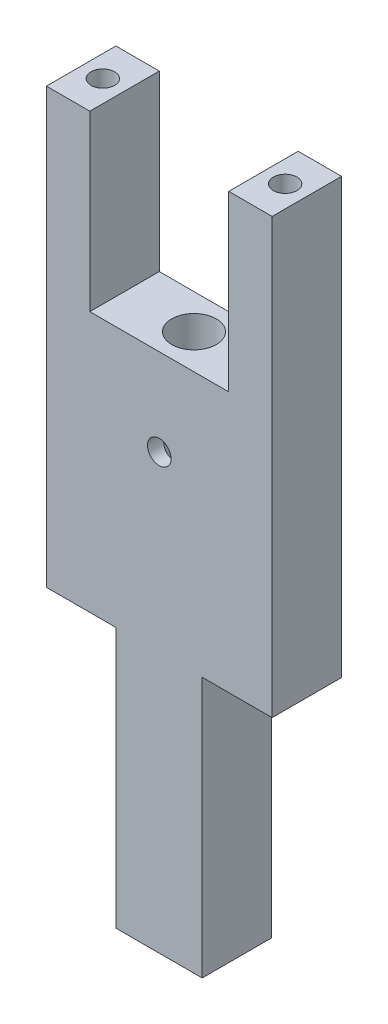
ISO-10303-21;
HEADER;
FILE_DESCRIPTION(('STEP AP214'),'2;1');
FILE_NAME('part.step','',(''),(''),'','','');
FILE_SCHEMA(('AUTOMOTIVE_DESIGN { 1 0 10303 214 1 1 1 1 }'));
ENDSEC;
DATA;
#1=APPLICATION_CONTEXT('core data for automotive mechanical design processes');
#2=APPLICATION_PROTOCOL_DEFINITION('international standard','automotive_design',2000,#1);
#3=PRODUCT_CONTEXT('',#1,'mechanical');
#4=PRODUCT('Part','Part','',(#3));
#5=PRODUCT_RELATED_PRODUCT_CATEGORY('part','',(#4));
#6=PRODUCT_DEFINITION_FORMATION('','',#4);
#7=PRODUCT_DEFINITION_CONTEXT('part definition',#1,'design');
#8=PRODUCT_DEFINITION('design','',#6,#7);
#9=PRODUCT_DEFINITION_SHAPE('','',#8);
#10=(LENGTH_UNIT() NAMED_UNIT(*) SI_UNIT(.MILLI.,.METRE.));
#11=(NAMED_UNIT(*) PLANE_ANGLE_UNIT() SI_UNIT($,.RADIAN.));
#12=(NAMED_UNIT(*) SI_UNIT($,.STERADIAN.) SOLID_ANGLE_UNIT());
#13=UNCERTAINTY_MEASURE_WITH_UNIT(LENGTH_MEASURE(1.E-05),#10,'distance_accuracy_value','');
#14=(GEOMETRIC_REPRESENTATION_CONTEXT(3) GLOBAL_UNCERTAINTY_ASSIGNED_CONTEXT((#13)) GLOBAL_UNIT_ASSIGNED_CONTEXT((#10,
#11,#12)) REPRESENTATION_CONTEXT('',''));
#15=CARTESIAN_POINT('',(0.,0.,0.));
#16=DIRECTION('',(0.,0.,1.));
#17=DIRECTION('',(1.,0.,0.));
#18=AXIS2_PLACEMENT_3D('',#15,#16,#17);
#19=CARTESIAN_POINT('',(-17.8779527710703,21.8143827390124,10.16));
#20=DIRECTION('',(0.,-1.,0.));
#21=DIRECTION('',(0.,0.,-1.));
#22=AXIS2_PLACEMENT_3D('',#19,#20,#21);
#23=PLANE('',#22);
#24=CARTESIAN_POINT('',(-14.7029527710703,21.8143827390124,5.08));
#25=DIRECTION('',(0.,1.,0.));
#26=DIRECTION('',(0.,0.,1.));
#27=AXIS2_PLACEMENT_3D('',#24,#25,#26);
#28=CIRCLE('',#27,1.72719999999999);
#29=CARTESIAN_POINT('',(-14.7029527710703,21.8143827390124,6.80719999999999));
#30=VERTEX_POINT('',#29);
#31=EDGE_CURVE('E153',#30,#30,#28,.T.);
#32=ORIENTED_EDGE('',*,*,#31,.F.);
#33=EDGE_LOOP('',(#32));
#34=FACE_BOUND('',#33,.T.);
#35=DIRECTION('',(-1.,0.,0.));
#36=VECTOR('',#35,1.);
#37=CARTESIAN_POINT('',(-17.8779527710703,21.8143827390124,10.16));
#38=LINE('',#37,#36);
#39=CARTESIAN_POINT('',(-11.5279527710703,21.8143827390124,10.16));
#40=VERTEX_POINT('',#39);
#41=CARTESIAN_POINT('',(-17.8779527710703,21.8143827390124,10.16));
#42=VERTEX_POINT('',#41);
#43=EDGE_CURVE('E270',#40,#42,#38,.T.);
#44=ORIENTED_EDGE('',*,*,#43,.F.);
#45=DIRECTION('',(0.,0.,1.));
#46=VECTOR('',#45,1.);
#47=CARTESIAN_POINT('',(-11.5279527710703,21.8143827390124,0.));
#48=LINE('',#47,#46);
#49=CARTESIAN_POINT('',(-11.5279527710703,21.8143827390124,0.));
#50=VERTEX_POINT('',#49);
#51=EDGE_CURVE('E199',#50,#40,#48,.T.);
#52=ORIENTED_EDGE('',*,*,#51,.F.);
#53=DIRECTION('',(-1.,0.,0.));
#54=VECTOR('',#53,1.);
#55=CARTESIAN_POINT('',(-17.8779527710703,21.8143827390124,0.));
#56=LINE('',#55,#54);
#57=CARTESIAN_POINT('',(-17.8779527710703,21.8143827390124,0.));
#58=VERTEX_POINT('',#57);
#59=EDGE_CURVE('E285',#50,#58,#56,.T.);
#60=ORIENTED_EDGE('',*,*,#59,.T.);
#61=DIRECTION('',(0.,0.,-1.));
#62=VECTOR('',#61,1.);
#63=CARTESIAN_POINT('',(-17.8779527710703,21.8143827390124,10.16));
#64=LINE('',#63,#62);
#65=EDGE_CURVE('E56',#42,#58,#64,.T.);
#66=ORIENTED_EDGE('',*,*,#65,.F.);
#67=EDGE_LOOP('',(#44,#52,#60,#66));
#68=FACE_BOUND('',#67,.T.);
#69=ADVANCED_FACE('F46',(#34,#68),#23,.F.);
#70=CARTESIAN_POINT('',(-17.8779527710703,-79.7856172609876,10.16));
#71=DIRECTION('',(0.,1.,0.));
#72=DIRECTION('',(0.,0.,1.));
#73=AXIS2_PLACEMENT_3D('',#70,#71,#72);
#74=PLANE('',#73);
#75=CARTESIAN_POINT('',(-1.36795277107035,-79.7856172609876,5.08));
#76=DIRECTION('',(0.,-1.,0.));
#77=DIRECTION('',(0.,0.,-1.));
#78=AXIS2_PLACEMENT_3D('',#75,#76,#77);
#79=CIRCLE('',#78,2.5527);
#80=CARTESIAN_POINT('',(-1.36795277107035,-79.7856172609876,2.5273));
#81=VERTEX_POINT('',#80);
#82=EDGE_CURVE('E668',#81,#81,#79,.T.);
#83=ORIENTED_EDGE('',*,*,#82,.F.);
#84=EDGE_LOOP('',(#83));
#85=FACE_BOUND('',#84,.T.);
#86=DIRECTION('',(1.,0.,0.));
#87=VECTOR('',#86,1.);
#88=CARTESIAN_POINT('',(-17.8779527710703,-79.7856172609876,10.16));
#89=LINE('',#88,#87);
#90=CARTESIAN_POINT('',(-7.71795277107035,-79.7856172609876,10.16));
#91=VERTEX_POINT('',#90);
#92=CARTESIAN_POINT('',(4.91014894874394,-79.7856172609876,10.16));
#93=VERTEX_POINT('',#92);
#94=EDGE_CURVE('E262',#91,#93,#89,.T.);
#95=ORIENTED_EDGE('',*,*,#94,.F.);
#96=DIRECTION('',(0.,0.,1.));
#97=VECTOR('',#96,1.);
#98=CARTESIAN_POINT('',(-7.71795277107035,-79.7856172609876,0.));
#99=LINE('',#98,#97);
#100=CARTESIAN_POINT('',(-7.71795277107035,-79.7856172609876,0.));
#101=VERTEX_POINT('',#100);
#102=EDGE_CURVE('E228',#101,#91,#99,.T.);
#103=ORIENTED_EDGE('',*,*,#102,.F.);
#104=DIRECTION('',(1.,0.,0.));
#105=VECTOR('',#104,1.);
#106=CARTESIAN_POINT('',(-17.8779527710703,-79.7856172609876,0.));
#107=LINE('',#106,#105);
#108=CARTESIAN_POINT('',(4.91014894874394,-79.7856172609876,0.));
#109=VERTEX_POINT('',#108);
#110=EDGE_CURVE('E278',#101,#109,#107,.T.);
#111=ORIENTED_EDGE('',*,*,#110,.T.);
#112=DIRECTION('',(0.,0.,1.));
#113=VECTOR('',#112,1.);
#114=CARTESIAN_POINT('',(4.91014894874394,-79.7856172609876,0.));
#115=LINE('',#114,#113);
#116=EDGE_CURVE('E71',#109,#93,#115,.T.);
#117=ORIENTED_EDGE('',*,*,#116,.T.);
#118=EDGE_LOOP('',(#95,#103,#111,#117));
#119=FACE_BOUND('',#118,.T.);
#120=ADVANCED_FACE('F377',(#85,#119),#74,.F.);
#121=CARTESIAN_POINT('',(15.1420472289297,21.8143827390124,10.16));
#122=DIRECTION('',(-1.,0.,0.));
#123=DIRECTION('',(0.,0.,1.));
#124=AXIS2_PLACEMENT_3D('',#121,#122,#123);
#125=PLANE('',#124);
#126=DIRECTION('',(0.,0.,1.));
#127=VECTOR('',#126,1.);
#128=CARTESIAN_POINT('',(15.1420472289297,-41.6856172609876,0.));
#129=LINE('',#128,#127);
#130=CARTESIAN_POINT('',(15.1420472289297,-41.6856172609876,0.));
#131=VERTEX_POINT('',#130);
#132=CARTESIAN_POINT('',(15.1420472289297,-41.6856172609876,10.16));
#133=VERTEX_POINT('',#132);
#134=EDGE_CURVE('E225',#131,#133,#129,.T.);
#135=ORIENTED_EDGE('',*,*,#134,.F.);
#136=DIRECTION('',(0.,1.,0.));
#137=VECTOR('',#136,1.);
#138=CARTESIAN_POINT('',(15.1420472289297,21.8143827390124,0.));
#139=LINE('',#138,#137);
#140=CARTESIAN_POINT('',(15.1420472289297,21.8143827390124,0.));
#141=VERTEX_POINT('',#140);
#142=EDGE_CURVE('E282',#131,#141,#139,.T.);
#143=ORIENTED_EDGE('',*,*,#142,.T.);
#144=DIRECTION('',(0.,0.,-1.));
#145=VECTOR('',#144,1.);
#146=CARTESIAN_POINT('',(15.1420472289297,21.8143827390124,10.16));
#147=LINE('',#146,#145);
#148=CARTESIAN_POINT('',(15.1420472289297,21.8143827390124,10.16));
#149=VERTEX_POINT('',#148);
#150=EDGE_CURVE('E11',#149,#141,#147,.T.);
#151=ORIENTED_EDGE('',*,*,#150,.F.);
#152=DIRECTION('',(0.,1.,0.));
#153=VECTOR('',#152,1.);
#154=CARTESIAN_POINT('',(15.1420472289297,21.8143827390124,10.16));
#155=LINE('',#154,#153);
#156=EDGE_CURVE('E267',#133,#149,#155,.T.);
#157=ORIENTED_EDGE('',*,*,#156,.F.);
#158=EDGE_LOOP('',(#135,#143,#151,#157));
#159=FACE_BOUND('',#158,.T.);
#160=ADVANCED_FACE('F368',(#159),#125,.F.);
#161=CARTESIAN_POINT('',(0.,0.,10.16));
#162=DIRECTION('',(0.,0.,1.));
#163=DIRECTION('',(1.,0.,0.));
#164=AXIS2_PLACEMENT_3D('',#161,#162,#163);
#165=PLANE('',#164);
#166=CARTESIAN_POINT('',(-1.36795277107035,-16.2856172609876,10.16));
#167=DIRECTION('',(0.,0.,1.));
#168=DIRECTION('',(1.,0.,0.));
#169=AXIS2_PLACEMENT_3D('',#166,#167,#168);
#170=CIRCLE('',#169,1.72719999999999);
#171=CARTESIAN_POINT('',(0.359247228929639,-16.2856172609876,10.16));
#172=VERTEX_POINT('',#171);
#173=EDGE_CURVE('E660',#172,#172,#170,.T.);
#174=ORIENTED_EDGE('',*,*,#173,.F.);
#175=EDGE_LOOP('',(#174));
#176=FACE_BOUND('',#175,.T.);
#177=DIRECTION('',(0.,-1.,0.));
#178=VECTOR('',#177,1.);
#179=CARTESIAN_POINT('',(-11.5279527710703,21.8143827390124,10.16));
#180=LINE('',#179,#178);
#181=CARTESIAN_POINT('',(-11.5279527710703,-3.58561726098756,10.16));
#182=VERTEX_POINT('',#181);
#183=EDGE_CURVE('E176',#40,#182,#180,.T.);
#184=ORIENTED_EDGE('',*,*,#183,.F.);
#185=ORIENTED_EDGE('',*,*,#43,.T.);
#186=DIRECTION('',(0.,-1.,0.));
#187=VECTOR('',#186,1.);
#188=CARTESIAN_POINT('',(-17.8779527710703,21.8143827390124,10.16));
#189=LINE('',#188,#187);
#190=CARTESIAN_POINT('',(-17.8779527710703,-41.6856172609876,10.16));
#191=VERTEX_POINT('',#190);
#192=EDGE_CURVE('E258',#42,#191,#189,.T.);
#193=ORIENTED_EDGE('',*,*,#192,.T.);
#194=DIRECTION('',(-1.,0.,0.));
#195=VECTOR('',#194,1.);
#196=CARTESIAN_POINT('',(0.,-41.6856172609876,10.16));
#197=LINE('',#196,#195);
#198=CARTESIAN_POINT('',(-7.71795277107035,-41.6856172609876,10.16));
#199=VERTEX_POINT('',#198);
#200=EDGE_CURVE('E216',#199,#191,#197,.T.);
#201=ORIENTED_EDGE('',*,*,#200,.F.);
#202=DIRECTION('',(0.,1.,0.));
#203=VECTOR('',#202,1.);
#204=CARTESIAN_POINT('',(-7.71795277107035,0.,10.16));
#205=LINE('',#204,#203);
#206=EDGE_CURVE('E221',#91,#199,#205,.T.);
#207=ORIENTED_EDGE('',*,*,#206,.F.);
#208=ORIENTED_EDGE('',*,*,#94,.T.);
#209=DIRECTION('',(0.,1.,0.));
#210=VECTOR('',#209,1.);
#211=CARTESIAN_POINT('',(4.91014894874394,0.,10.16));
#212=LINE('',#211,#210);
#213=CARTESIAN_POINT('',(4.91014894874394,-41.6856172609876,10.16));
#214=VERTEX_POINT('',#213);
#215=EDGE_CURVE('E242',#93,#214,#212,.T.);
#216=ORIENTED_EDGE('',*,*,#215,.T.);
#217=DIRECTION('',(1.,0.,0.));
#218=VECTOR('',#217,1.);
#219=CARTESIAN_POINT('',(0.,-41.6856172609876,10.16));
#220=LINE('',#219,#218);
#221=EDGE_CURVE('E202',#214,#133,#220,.T.);
#222=ORIENTED_EDGE('',*,*,#221,.T.);
#223=ORIENTED_EDGE('',*,*,#156,.T.);
#224=CARTESIAN_POINT('',(8.79204722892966,21.8143827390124,10.16));
#225=VERTEX_POINT('',#224);
#226=EDGE_CURVE('E271',#149,#225,#38,.T.);
#227=ORIENTED_EDGE('',*,*,#226,.T.);
#228=DIRECTION('',(0.,1.,0.));
#229=VECTOR('',#228,1.);
#230=CARTESIAN_POINT('',(8.79204722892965,21.8143827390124,10.16));
#231=LINE('',#230,#229);
#232=CARTESIAN_POINT('',(8.79204722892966,-3.58561726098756,10.16));
#233=VERTEX_POINT('',#232);
#234=EDGE_CURVE('E63',#233,#225,#231,.T.);
#235=ORIENTED_EDGE('',*,*,#234,.F.);
#236=DIRECTION('',(1.,0.,0.));
#237=VECTOR('',#236,1.);
#238=CARTESIAN_POINT('',(-11.5279527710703,-3.58561726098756,10.16));
#239=LINE('',#238,#237);
#240=EDGE_CURVE('E193',#182,#233,#239,.T.);
#241=ORIENTED_EDGE('',*,*,#240,.F.);
#242=EDGE_LOOP('',(#184,#185,#193,#201,#207,#208,#216,#222,#223,#227,#235,#241));
#243=FACE_BOUND('',#242,.T.);
#244=ADVANCED_FACE('F308',(#176,#243),#165,.T.);
#245=CARTESIAN_POINT('',(0.,0.,0.));
#246=DIRECTION('',(0.,0.,1.));
#247=DIRECTION('',(1.,0.,0.));
#248=AXIS2_PLACEMENT_3D('',#245,#246,#247);
#249=PLANE('',#248);
#250=ORIENTED_EDGE('',*,*,#59,.F.);
#251=DIRECTION('',(0.,-1.,0.));
#252=VECTOR('',#251,1.);
#253=CARTESIAN_POINT('',(-11.5279527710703,21.8143827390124,0.));
#254=LINE('',#253,#252);
#255=CARTESIAN_POINT('',(-11.5279527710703,-3.58561726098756,0.));
#256=VERTEX_POINT('',#255);
#257=EDGE_CURVE('E177',#50,#256,#254,.T.);
#258=ORIENTED_EDGE('',*,*,#257,.T.);
#259=DIRECTION('',(1.,0.,0.));
#260=VECTOR('',#259,1.);
#261=CARTESIAN_POINT('',(-11.5279527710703,-3.58561726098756,0.));
#262=LINE('',#261,#260);
#263=CARTESIAN_POINT('',(8.79204722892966,-3.58561726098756,0.));
#264=VERTEX_POINT('',#263);
#265=EDGE_CURVE('E181',#256,#264,#262,.T.);
#266=ORIENTED_EDGE('',*,*,#265,.T.);
#267=DIRECTION('',(0.,1.,0.));
#268=VECTOR('',#267,1.);
#269=CARTESIAN_POINT('',(8.79204722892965,21.8143827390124,0.));
#270=LINE('',#269,#268);
#271=CARTESIAN_POINT('',(8.79204722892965,21.8143827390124,0.));
#272=VERTEX_POINT('',#271);
#273=EDGE_CURVE('E185',#264,#272,#270,.T.);
#274=ORIENTED_EDGE('',*,*,#273,.T.);
#275=EDGE_CURVE('E263',#141,#272,#56,.T.);
#276=ORIENTED_EDGE('',*,*,#275,.F.);
#277=ORIENTED_EDGE('',*,*,#142,.F.);
#278=DIRECTION('',(1.,0.,0.));
#279=VECTOR('',#278,1.);
#280=CARTESIAN_POINT('',(0.,-41.6856172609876,0.));
#281=LINE('',#280,#279);
#282=CARTESIAN_POINT('',(4.91014894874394,-41.6856172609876,0.));
#283=VERTEX_POINT('',#282);
#284=EDGE_CURVE('E238',#283,#131,#281,.T.);
#285=ORIENTED_EDGE('',*,*,#284,.F.);
#286=DIRECTION('',(0.,1.,0.));
#287=VECTOR('',#286,1.);
#288=CARTESIAN_POINT('',(4.91014894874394,0.,0.));
#289=LINE('',#288,#287);
#290=EDGE_CURVE('E241',#109,#283,#289,.T.);
#291=ORIENTED_EDGE('',*,*,#290,.F.);
#292=ORIENTED_EDGE('',*,*,#110,.F.);
#293=DIRECTION('',(0.,1.,0.));
#294=VECTOR('',#293,1.);
#295=CARTESIAN_POINT('',(-7.71795277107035,0.,0.));
#296=LINE('',#295,#294);
#297=CARTESIAN_POINT('',(-7.71795277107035,-41.6856172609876,0.));
#298=VERTEX_POINT('',#297);
#299=EDGE_CURVE('E211',#101,#298,#296,.T.);
#300=ORIENTED_EDGE('',*,*,#299,.T.);
#301=DIRECTION('',(-1.,0.,0.));
#302=VECTOR('',#301,1.);
#303=CARTESIAN_POINT('',(0.,-41.6856172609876,0.));
#304=LINE('',#303,#302);
#305=CARTESIAN_POINT('',(-17.8779527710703,-41.6856172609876,0.));
#306=VERTEX_POINT('',#305);
#307=EDGE_CURVE('E215',#298,#306,#304,.T.);
#308=ORIENTED_EDGE('',*,*,#307,.T.);
#309=DIRECTION('',(0.,-1.,0.));
#310=VECTOR('',#309,1.);
#311=CARTESIAN_POINT('',(-17.8779527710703,21.8143827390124,0.));
#312=LINE('',#311,#310);
#313=EDGE_CURVE('E231',#58,#306,#312,.T.);
#314=ORIENTED_EDGE('',*,*,#313,.F.);
#315=EDGE_LOOP('',(#250,#258,#266,#274,#276,#277,#285,#291,#292,#300,#308,#314));
#316=FACE_BOUND('',#315,.T.);
#317=ADVANCED_FACE('F300',(#316),#249,.F.);
#318=CARTESIAN_POINT('',(-17.8779527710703,21.8143827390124,10.16));
#319=DIRECTION('',(1.,0.,0.));
#320=DIRECTION('',(0.,0.,-1.));
#321=AXIS2_PLACEMENT_3D('',#318,#319,#320);
#322=PLANE('',#321);
#323=ORIENTED_EDGE('',*,*,#313,.T.);
#324=DIRECTION('',(0.,0.,1.));
#325=VECTOR('',#324,1.);
#326=CARTESIAN_POINT('',(-17.8779527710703,-41.6856172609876,0.));
#327=LINE('',#326,#325);
#328=EDGE_CURVE('E232',#306,#191,#327,.T.);
#329=ORIENTED_EDGE('',*,*,#328,.T.);
#330=ORIENTED_EDGE('',*,*,#192,.F.);
#331=ORIENTED_EDGE('',*,*,#65,.T.);
#332=EDGE_LOOP('',(#323,#329,#330,#331));
#333=FACE_BOUND('',#332,.T.);
#334=ADVANCED_FACE('F48',(#333),#322,.F.);
#335=CARTESIAN_POINT('',(11.9670472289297,21.8143827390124,5.08));
#336=DIRECTION('',(0.,1.,0.));
#337=DIRECTION('',(0.,0.,1.));
#338=AXIS2_PLACEMENT_3D('',#335,#336,#337);
#339=CIRCLE('',#338,1.72719999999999);
#340=CARTESIAN_POINT('',(11.9670472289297,21.8143827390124,6.80719999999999));
#341=VERTEX_POINT('',#340);
#342=EDGE_CURVE('E152',#341,#341,#339,.T.);
#343=ORIENTED_EDGE('',*,*,#342,.F.);
#344=EDGE_LOOP('',(#343));
#345=FACE_BOUND('',#344,.T.);
#346=ORIENTED_EDGE('',*,*,#275,.T.);
#347=DIRECTION('',(0.,0.,1.));
#348=VECTOR('',#347,1.);
#349=CARTESIAN_POINT('',(8.79204722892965,21.8143827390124,0.));
#350=LINE('',#349,#348);
#351=EDGE_CURVE('E203',#272,#225,#350,.T.);
#352=ORIENTED_EDGE('',*,*,#351,.T.);
#353=ORIENTED_EDGE('',*,*,#226,.F.);
#354=ORIENTED_EDGE('',*,*,#150,.T.);
#355=EDGE_LOOP('',(#346,#352,#353,#354));
#356=FACE_BOUND('',#355,.T.);
#357=ADVANCED_FACE('F362',(#345,#356),#23,.F.);
#358=CARTESIAN_POINT('',(0.,-41.6856172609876,0.));
#359=DIRECTION('',(0.,-1.,0.));
#360=DIRECTION('',(0.,0.,-1.));
#361=AXIS2_PLACEMENT_3D('',#358,#359,#360);
#362=PLANE('',#361);
#363=ORIENTED_EDGE('',*,*,#221,.F.);
#364=DIRECTION('',(0.,0.,1.));
#365=VECTOR('',#364,1.);
#366=CARTESIAN_POINT('',(4.91014894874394,-41.6856172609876,0.));
#367=LINE('',#366,#365);
#368=EDGE_CURVE('E245',#283,#214,#367,.T.);
#369=ORIENTED_EDGE('',*,*,#368,.F.);
#370=ORIENTED_EDGE('',*,*,#284,.T.);
#371=ORIENTED_EDGE('',*,*,#134,.T.);
#372=EDGE_LOOP('',(#363,#369,#370,#371));
#373=FACE_BOUND('',#372,.T.);
#374=ADVANCED_FACE('F373',(#373),#362,.T.);
#375=CARTESIAN_POINT('',(4.91014894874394,0.,0.));
#376=DIRECTION('',(1.,0.,0.));
#377=DIRECTION('',(0.,0.,-1.));
#378=AXIS2_PLACEMENT_3D('',#375,#376,#377);
#379=PLANE('',#378);
#380=ORIENTED_EDGE('',*,*,#215,.F.);
#381=ORIENTED_EDGE('',*,*,#116,.F.);
#382=ORIENTED_EDGE('',*,*,#290,.T.);
#383=ORIENTED_EDGE('',*,*,#368,.T.);
#384=EDGE_LOOP('',(#380,#381,#382,#383));
#385=FACE_BOUND('',#384,.T.);
#386=ADVANCED_FACE('F374',(#385),#379,.T.);
#387=CARTESIAN_POINT('',(-7.71795277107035,0.,0.));
#388=DIRECTION('',(1.,0.,0.));
#389=DIRECTION('',(0.,0.,-1.));
#390=AXIS2_PLACEMENT_3D('',#387,#388,#389);
#391=PLANE('',#390);
#392=ORIENTED_EDGE('',*,*,#206,.T.);
#393=DIRECTION('',(0.,0.,1.));
#394=VECTOR('',#393,1.);
#395=CARTESIAN_POINT('',(-7.71795277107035,-41.6856172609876,0.));
#396=LINE('',#395,#394);
#397=EDGE_CURVE('E220',#298,#199,#396,.T.);
#398=ORIENTED_EDGE('',*,*,#397,.F.);
#399=ORIENTED_EDGE('',*,*,#299,.F.);
#400=ORIENTED_EDGE('',*,*,#102,.T.);
#401=EDGE_LOOP('',(#392,#398,#399,#400));
#402=FACE_BOUND('',#401,.T.);
#403=ADVANCED_FACE('F380',(#402),#391,.F.);
#404=CARTESIAN_POINT('',(0.,-41.6856172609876,0.));
#405=DIRECTION('',(0.,1.,0.));
#406=DIRECTION('',(0.,0.,1.));
#407=AXIS2_PLACEMENT_3D('',#404,#405,#406);
#408=PLANE('',#407);
#409=ORIENTED_EDGE('',*,*,#200,.T.);
#410=ORIENTED_EDGE('',*,*,#328,.F.);
#411=ORIENTED_EDGE('',*,*,#307,.F.);
#412=ORIENTED_EDGE('',*,*,#397,.T.);
#413=EDGE_LOOP('',(#409,#410,#411,#412));
#414=FACE_BOUND('',#413,.T.);
#415=ADVANCED_FACE('F304',(#414),#408,.F.);
#416=CARTESIAN_POINT('',(-11.5279527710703,21.8143827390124,0.));
#417=DIRECTION('',(-1.,0.,0.));
#418=DIRECTION('',(0.,-1.,0.));
#419=AXIS2_PLACEMENT_3D('',#416,#417,#418);
#420=PLANE('',#419);
#421=ORIENTED_EDGE('',*,*,#183,.T.);
#422=DIRECTION('',(0.,0.,1.));
#423=VECTOR('',#422,1.);
#424=CARTESIAN_POINT('',(-11.5279527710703,-3.58561726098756,0.));
#425=LINE('',#424,#423);
#426=EDGE_CURVE('E189',#256,#182,#425,.T.);
#427=ORIENTED_EDGE('',*,*,#426,.F.);
#428=ORIENTED_EDGE('',*,*,#257,.F.);
#429=ORIENTED_EDGE('',*,*,#51,.T.);
#430=EDGE_LOOP('',(#421,#427,#428,#429));
#431=FACE_BOUND('',#430,.T.);
#432=ADVANCED_FACE('F353',(#431),#420,.F.);
#433=CARTESIAN_POINT('',(8.79204722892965,21.8143827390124,0.));
#434=DIRECTION('',(1.,0.,0.));
#435=DIRECTION('',(0.,1.,0.));
#436=AXIS2_PLACEMENT_3D('',#433,#434,#435);
#437=PLANE('',#436);
#438=ORIENTED_EDGE('',*,*,#234,.T.);
#439=ORIENTED_EDGE('',*,*,#351,.F.);
#440=ORIENTED_EDGE('',*,*,#273,.F.);
#441=DIRECTION('',(0.,0.,1.));
#442=VECTOR('',#441,1.);
#443=CARTESIAN_POINT('',(8.79204722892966,-3.58561726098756,0.));
#444=LINE('',#443,#442);
#445=EDGE_CURVE('E206',#264,#233,#444,.T.);
#446=ORIENTED_EDGE('',*,*,#445,.T.);
#447=EDGE_LOOP('',(#438,#439,#440,#446));
#448=FACE_BOUND('',#447,.T.);
#449=ADVANCED_FACE('F359',(#448),#437,.F.);
#450=CARTESIAN_POINT('',(-11.5279527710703,-3.58561726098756,0.));
#451=DIRECTION('',(0.,-1.,0.));
#452=DIRECTION('',(0.,0.,-1.));
#453=AXIS2_PLACEMENT_3D('',#450,#451,#452);
#454=PLANE('',#453);
#455=CARTESIAN_POINT('',(-1.36795277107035,-3.58561726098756,5.08));
#456=DIRECTION('',(0.,1.,0.));
#457=DIRECTION('',(0.,0.,1.));
#458=AXIS2_PLACEMENT_3D('',#455,#456,#457);
#459=CIRCLE('',#458,3.26389999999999);
#460=CARTESIAN_POINT('',(-1.36795277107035,-3.58561726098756,8.34389999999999));
#461=VERTEX_POINT('',#460);
#462=EDGE_CURVE('E168',#461,#461,#459,.T.);
#463=ORIENTED_EDGE('',*,*,#462,.F.);
#464=EDGE_LOOP('',(#463));
#465=FACE_BOUND('',#464,.T.);
#466=ORIENTED_EDGE('',*,*,#240,.T.);
#467=ORIENTED_EDGE('',*,*,#445,.F.);
#468=ORIENTED_EDGE('',*,*,#265,.F.);
#469=ORIENTED_EDGE('',*,*,#426,.T.);
#470=EDGE_LOOP('',(#466,#467,#468,#469));
#471=FACE_BOUND('',#470,.T.);
#472=ADVANCED_FACE('F358',(#465,#471),#454,.F.);
#473=CARTESIAN_POINT('',(-1.36795277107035,-67.0856172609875,5.08));
#474=DIRECTION('',(0.,1.,0.));
#475=DIRECTION('',(0.,0.,1.));
#476=AXIS2_PLACEMENT_3D('',#473,#474,#475);
#477=CONICAL_SURFACE('',#476,3.26389999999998,1.02974425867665);
#478=CARTESIAN_POINT('',(-1.36795277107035,-67.51294933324,5.08));
#479=DIRECTION('',(0.,1.,0.));
#480=DIRECTION('',(0.,0.,1.));
#481=AXIS2_PLACEMENT_3D('',#478,#479,#480);
#482=CIRCLE('',#481,2.5527);
#483=CARTESIAN_POINT('',(-1.36795277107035,-67.51294933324,7.6327));
#484=VERTEX_POINT('',#483);
#485=EDGE_CURVE('E50',#484,#484,#482,.F.);
#486=ORIENTED_EDGE('',*,*,#485,.T.);
#487=EDGE_LOOP('',(#486));
#488=FACE_BOUND('',#487,.T.);
#489=CARTESIAN_POINT('',(-1.36795277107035,-67.0856172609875,5.08));
#490=DIRECTION('',(0.,1.,0.));
#491=DIRECTION('',(0.,0.,1.));
#492=AXIS2_PLACEMENT_3D('',#489,#490,#491);
#493=CIRCLE('',#492,3.26389999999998);
#494=CARTESIAN_POINT('',(-1.36795277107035,-67.0856172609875,8.34389999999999));
#495=VERTEX_POINT('',#494);
#496=EDGE_CURVE('E172',#495,#495,#493,.T.);
#497=ORIENTED_EDGE('',*,*,#496,.T.);
#498=EDGE_LOOP('',(#497));
#499=FACE_BOUND('',#498,.T.);
#500=ADVANCED_FACE('F423',(#488,#499),#477,.F.);
#501=CARTESIAN_POINT('',(-1.36795277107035,-3.58561726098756,5.08));
#502=DIRECTION('',(0.,1.,0.));
#503=DIRECTION('',(0.,0.,1.));
#504=AXIS2_PLACEMENT_3D('',#501,#502,#503);
#505=CYLINDRICAL_SURFACE('',#504,3.26389999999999);
#506=CARTESIAN_POINT('',(-1.36795277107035,-18.0128172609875,8.34389999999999));
#507=CARTESIAN_POINT('',(-1.27779819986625,-18.0128113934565,8.34389478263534));
#508=CARTESIAN_POINT('',(-1.18755580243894,-18.0057174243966,8.34012573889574));
#509=CARTESIAN_POINT('',(-1.00977898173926,-17.9776749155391,8.32541916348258));
#510=CARTESIAN_POINT('',(-0.922249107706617,-17.9567042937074,8.31447020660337));
#511=CARTESIAN_POINT('',(-0.752731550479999,-17.901978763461,8.28653991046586));
#512=CARTESIAN_POINT('',(-0.670723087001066,-17.8682753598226,8.26958289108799));
#513=CARTESIAN_POINT('',(-0.513669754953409,-17.7893304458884,8.23115690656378));
#514=CARTESIAN_POINT('',(-0.438624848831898,-17.7440889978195,8.20968796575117));
#515=CARTESIAN_POINT('',(-0.292109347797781,-17.6400087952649,8.16251651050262));
#516=CARTESIAN_POINT('',(-0.221193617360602,-17.5804742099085,8.13662893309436));
#517=CARTESIAN_POINT('',(-0.0898331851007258,-17.4510128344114,8.0840753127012));
#518=CARTESIAN_POINT('',(-0.0293974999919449,-17.3810771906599,8.05740862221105));
#519=CARTESIAN_POINT('',(0.084731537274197,-17.2253302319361,8.0035390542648));
#520=CARTESIAN_POINT('',(0.137338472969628,-17.1386584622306,7.97650152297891));
#521=CARTESIAN_POINT('',(0.227014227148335,-16.9561502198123,7.92811087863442));
#522=CARTESIAN_POINT('',(0.264094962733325,-16.860320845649,7.90675341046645));
#523=CARTESIAN_POINT('',(0.319108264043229,-16.6682217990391,7.87425113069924));
#524=CARTESIAN_POINT('',(0.338089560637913,-16.5723512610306,7.86255311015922));
#525=CARTESIAN_POINT('',(0.359523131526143,-16.3781351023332,7.84930471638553));
#526=CARTESIAN_POINT('',(0.361995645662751,-16.27979266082,7.84774191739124));
#527=CARTESIAN_POINT('',(0.351106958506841,-16.0980577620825,7.85450706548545));
#528=CARTESIAN_POINT('',(0.339882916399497,-16.0144743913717,7.86150035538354));
#529=CARTESIAN_POINT('',(0.305667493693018,-15.8506192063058,7.88221959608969));
#530=CARTESIAN_POINT('',(0.282671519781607,-15.7703486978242,7.89594817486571));
#531=CARTESIAN_POINT('',(0.225202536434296,-15.613124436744,7.92886134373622));
#532=CARTESIAN_POINT('',(0.190481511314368,-15.5362868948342,7.9481624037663));
#533=CARTESIAN_POINT('',(0.110750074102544,-15.3891416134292,7.99007010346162));
#534=CARTESIAN_POINT('',(0.0657350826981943,-15.3188367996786,8.01267821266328));
#535=CARTESIAN_POINT('',(-0.0408626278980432,-15.1760722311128,8.06258498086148));
#536=CARTESIAN_POINT('',(-0.103898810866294,-15.1047657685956,8.09008969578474));
#537=CARTESIAN_POINT('',(-0.241065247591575,-14.9732222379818,8.14408281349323));
#538=CARTESIAN_POINT('',(-0.315202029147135,-14.912991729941,8.17057060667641));
#539=CARTESIAN_POINT('',(-0.477837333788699,-14.8019900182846,8.22140062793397));
#540=CARTESIAN_POINT('',(-0.566918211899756,-14.7519665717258,8.24553041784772));
#541=CARTESIAN_POINT('',(-0.7538234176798,-14.6680474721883,8.28702668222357));
#542=CARTESIAN_POINT('',(-0.8516399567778,-14.6341376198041,8.30439910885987));
#543=CARTESIAN_POINT('',(-1.04391582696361,-14.5864586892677,8.32909034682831));
#544=CARTESIAN_POINT('',(-1.13789855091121,-14.5711650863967,8.33716661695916));
#545=CARTESIAN_POINT('',(-1.3274252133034,-14.5562830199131,8.34502307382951));
#546=CARTESIAN_POINT('',(-1.42296824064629,-14.5566856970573,8.34480794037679));
#547=CARTESIAN_POINT('',(-1.60382946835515,-14.5724084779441,8.33651261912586));
#548=CARTESIAN_POINT('',(-1.68930086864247,-14.5863977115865,8.32913414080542));
#549=CARTESIAN_POINT('',(-1.85648159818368,-14.6267155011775,8.30823200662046));
#550=CARTESIAN_POINT('',(-1.93819053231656,-14.6530453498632,8.29470770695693));
#551=CARTESIAN_POINT('',(-2.09798041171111,-14.7178463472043,8.2622827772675));
#552=CARTESIAN_POINT('',(-2.17591584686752,-14.756609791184,8.24325392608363));
#553=CARTESIAN_POINT('',(-2.32440563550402,-14.8448241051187,8.20156979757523));
#554=CARTESIAN_POINT('',(-2.39495705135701,-14.8942792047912,8.17891308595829));
#555=CARTESIAN_POINT('',(-2.53467095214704,-15.0085204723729,8.12924195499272));
#556=CARTESIAN_POINT('',(-2.60288430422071,-15.0743787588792,8.10202044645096));
#557=CARTESIAN_POINT('',(-2.72777301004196,-15.2164736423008,8.04792413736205));
#558=CARTESIAN_POINT('',(-2.78443801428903,-15.2927194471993,8.02104966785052));
#559=CARTESIAN_POINT('',(-2.88817334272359,-15.4595385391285,7.96886846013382));
#560=CARTESIAN_POINT('',(-2.93438355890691,-15.5507202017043,7.94377628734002));
#561=CARTESIAN_POINT('',(-3.01032747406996,-15.741277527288,7.90091720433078));
#562=CARTESIAN_POINT('',(-3.04008442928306,-15.8406413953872,7.8831399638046));
#563=CARTESIAN_POINT('',(-3.07935802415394,-16.0344167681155,7.85931959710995));
#564=CARTESIAN_POINT('',(-3.09057193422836,-16.1283598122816,7.85229754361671));
#565=CARTESIAN_POINT('',(-3.09743989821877,-16.3170115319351,7.84802148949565));
#566=CARTESIAN_POINT('',(-3.09310397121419,-16.4117196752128,7.85076119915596));
#567=CARTESIAN_POINT('',(-3.07062436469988,-16.587333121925,7.8646156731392));
#568=CARTESIAN_POINT('',(-3.05417149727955,-16.6685477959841,7.87470334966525));
#569=CARTESIAN_POINT('',(-3.01019728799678,-16.8269225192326,7.90076682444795));
#570=CARTESIAN_POINT('',(-2.98267193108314,-16.9040810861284,7.91674475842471));
#571=CARTESIAN_POINT('',(-2.91537392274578,-17.0577563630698,7.95403858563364));
#572=CARTESIAN_POINT('',(-2.87492140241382,-17.1339052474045,7.97563397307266));
#573=CARTESIAN_POINT('',(-2.78360308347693,-17.2788443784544,8.02135766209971));
#574=CARTESIAN_POINT('',(-2.73273167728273,-17.3476306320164,8.04548732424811));
#575=CARTESIAN_POINT('',(-2.61360292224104,-17.4860549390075,8.09764774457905));
#576=CARTESIAN_POINT('',(-2.54390351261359,-17.5544330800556,8.12574687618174));
#577=CARTESIAN_POINT('',(-2.39339987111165,-17.6788921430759,8.17965957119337));
#578=CARTESIAN_POINT('',(-2.31258867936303,-17.7349653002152,8.20547168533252));
#579=CARTESIAN_POINT('',(-2.13962217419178,-17.8341317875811,8.25266077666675));
#580=CARTESIAN_POINT('',(-2.04725784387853,-17.8769152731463,8.2739287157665));
#581=CARTESIAN_POINT('',(-1.85527022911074,-17.9457606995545,8.30877827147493));
#582=CARTESIAN_POINT('',(-1.75566731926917,-17.9718676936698,8.32238058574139));
#583=CARTESIAN_POINT('',(-1.60708698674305,-17.9968558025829,8.33547613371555));
#584=CARTESIAN_POINT('',(-1.55952149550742,-18.0028304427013,8.33862450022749));
#585=CARTESIAN_POINT('',(-1.46396323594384,-18.0108127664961,8.34283783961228));
#586=CARTESIAN_POINT('',(-1.41597046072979,-18.0128203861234,8.3439027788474));
#587=CARTESIAN_POINT('',(-1.36795277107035,-18.0128172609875,8.34389999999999));
#588=B_SPLINE_CURVE_WITH_KNOTS('',3,(#506,#507,#508,#509,#510,#511,#512,#513,#514,#515,#516,
#517,#518,#519,#520,#521,#522,#523,#524,#525,#526,#527,#528,#529,#530,#531,#532,#533,#534,#535,
#536,#537,#538,#539,#540,#541,#542,#543,#544,#545,#546,#547,#548,#549,#550,#551,#552,#553,#554,
#555,#556,#557,#558,#559,#560,#561,#562,#563,#564,#565,#566,#567,#568,#569,#570,#571,#572,#573,
#574,#575,#576,#577,#578,#579,#580,#581,#582,#583,#584,#585,#586,#587),.UNSPECIFIED.,.T.,.F.,(4,
2,2,2,2,2,2,2,2,2,2,2,2,2,2,2,2,2,2,2,2,2,2,2,2,2,2,2,2,2,2,2,2,2,2,2,2,2,2,2,4),(0.,
0.270269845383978,0.540970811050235,0.810588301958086,1.08020433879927,1.36745579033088,
1.65495317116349,1.9681631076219,2.28113219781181,2.57460932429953,2.86772658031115,
3.12040926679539,3.37319062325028,3.63169404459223,3.89031268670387,4.18625469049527,
4.48237141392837,4.79559987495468,5.10855180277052,5.39363778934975,5.67856287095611,
5.93812905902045,6.19772244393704,6.46393096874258,6.73024500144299,7.02493769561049,
7.31989333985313,7.63396966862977,7.9476009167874,8.23050707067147,8.51323097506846,
8.76257203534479,9.01200359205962,9.27765077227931,9.54344130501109,9.84688666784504,
10.1505229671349,10.4607831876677,10.7702016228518,10.9141491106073,11.0580989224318),.UNSPECIFIED.);
#589=CARTESIAN_POINT('',(-1.36795277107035,-18.0128172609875,8.34389999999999));
#590=VERTEX_POINT('',#589);
#591=EDGE_CURVE('E663',#590,#590,#588,.T.);
#592=ORIENTED_EDGE('',*,*,#591,.T.);
#593=EDGE_LOOP('',(#592));
#594=FACE_BOUND('',#593,.T.);
#595=ORIENTED_EDGE('',*,*,#496,.F.);
#596=EDGE_LOOP('',(#595));
#597=FACE_BOUND('',#596,.T.);
#598=ORIENTED_EDGE('',*,*,#462,.T.);
#599=EDGE_LOOP('',(#598));
#600=FACE_BOUND('',#599,.T.);
#601=ADVANCED_FACE('F415',(#594,#597,#600),#505,.F.);
#602=CARTESIAN_POINT('',(11.9670472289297,9.11438273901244,5.08));
#603=DIRECTION('',(0.,1.,0.));
#604=DIRECTION('',(0.,0.,1.));
#605=AXIS2_PLACEMENT_3D('',#602,#603,#604);
#606=CONICAL_SURFACE('',#605,1.7272,1.02974425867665);
#607=CARTESIAN_POINT('',(11.9670472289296,8.07657627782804,5.08));
#608=VERTEX_POINT('',#607);
#609=VERTEX_LOOP('',#608);
#610=FACE_BOUND('',#609,.T.);
#611=CARTESIAN_POINT('',(11.9670472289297,9.11438273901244,5.08));
#612=DIRECTION('',(0.,1.,0.));
#613=DIRECTION('',(0.,0.,1.));
#614=AXIS2_PLACEMENT_3D('',#611,#612,#613);
#615=CIRCLE('',#614,1.7272);
#616=CARTESIAN_POINT('',(11.9670472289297,9.11438273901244,6.8072));
#617=VERTEX_POINT('',#616);
#618=EDGE_CURVE('E159',#617,#617,#615,.T.);
#619=ORIENTED_EDGE('',*,*,#618,.T.);
#620=EDGE_LOOP('',(#619));
#621=FACE_BOUND('',#620,.T.);
#622=ADVANCED_FACE('F409',(#610,#621),#606,.F.);
#623=CARTESIAN_POINT('',(11.9670472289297,21.8143827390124,5.08));
#624=DIRECTION('',(0.,1.,0.));
#625=DIRECTION('',(0.,0.,1.));
#626=AXIS2_PLACEMENT_3D('',#623,#624,#625);
#627=CYLINDRICAL_SURFACE('',#626,1.7272);
#628=ORIENTED_EDGE('',*,*,#618,.F.);
#629=EDGE_LOOP('',(#628));
#630=FACE_BOUND('',#629,.T.);
#631=ORIENTED_EDGE('',*,*,#342,.T.);
#632=EDGE_LOOP('',(#631));
#633=FACE_BOUND('',#632,.T.);
#634=ADVANCED_FACE('F145',(#630,#633),#627,.F.);
#635=CARTESIAN_POINT('',(-14.7029527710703,9.11438273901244,5.08));
#636=DIRECTION('',(0.,1.,0.));
#637=DIRECTION('',(0.,0.,1.));
#638=AXIS2_PLACEMENT_3D('',#635,#636,#637);
#639=CONICAL_SURFACE('',#638,1.7272,1.02974425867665);
#640=CARTESIAN_POINT('',(-14.7029527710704,8.07657627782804,5.08));
#641=VERTEX_POINT('',#640);
#642=VERTEX_LOOP('',#641);
#643=FACE_BOUND('',#642,.T.);
#644=CARTESIAN_POINT('',(-14.7029527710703,9.11438273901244,5.08));
#645=DIRECTION('',(0.,1.,0.));
#646=DIRECTION('',(0.,0.,1.));
#647=AXIS2_PLACEMENT_3D('',#644,#645,#646);
#648=CIRCLE('',#647,1.7272);
#649=CARTESIAN_POINT('',(-14.7029527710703,9.11438273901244,6.8072));
#650=VERTEX_POINT('',#649);
#651=EDGE_CURVE('E149',#650,#650,#648,.T.);
#652=ORIENTED_EDGE('',*,*,#651,.T.);
#653=EDGE_LOOP('',(#652));
#654=FACE_BOUND('',#653,.T.);
#655=ADVANCED_FACE('F141',(#643,#654),#639,.F.);
#656=CARTESIAN_POINT('',(-14.7029527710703,21.8143827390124,5.08));
#657=DIRECTION('',(0.,1.,0.));
#658=DIRECTION('',(0.,0.,1.));
#659=AXIS2_PLACEMENT_3D('',#656,#657,#658);
#660=CYLINDRICAL_SURFACE('',#659,1.7272);
#661=ORIENTED_EDGE('',*,*,#651,.F.);
#662=EDGE_LOOP('',(#661));
#663=FACE_BOUND('',#662,.T.);
#664=ORIENTED_EDGE('',*,*,#31,.T.);
#665=EDGE_LOOP('',(#664));
#666=FACE_BOUND('',#665,.T.);
#667=ADVANCED_FACE('F144',(#663,#666),#660,.F.);
#668=CARTESIAN_POINT('',(-1.36795277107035,-79.7856172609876,5.08));
#669=DIRECTION('',(0.,-1.,0.));
#670=DIRECTION('',(0.,0.,-1.));
#671=AXIS2_PLACEMENT_3D('',#668,#669,#670);
#672=CYLINDRICAL_SURFACE('',#671,2.5527);
#673=ORIENTED_EDGE('',*,*,#82,.T.);
#674=EDGE_LOOP('',(#673));
#675=FACE_BOUND('',#674,.T.);
#676=ORIENTED_EDGE('',*,*,#485,.F.);
#677=EDGE_LOOP('',(#676));
#678=FACE_BOUND('',#677,.T.);
#679=ADVANCED_FACE('F481',(#675,#678),#672,.F.);
#680=CARTESIAN_POINT('',(-1.36795277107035,-16.2856172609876,10.16));
#681=DIRECTION('',(0.,0.,1.));
#682=DIRECTION('',(1.,0.,0.));
#683=AXIS2_PLACEMENT_3D('',#680,#681,#682);
#684=CYLINDRICAL_SURFACE('',#683,1.72719999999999);
#685=ORIENTED_EDGE('',*,*,#591,.F.);
#686=EDGE_LOOP('',(#685));
#687=FACE_BOUND('',#686,.T.);
#688=ORIENTED_EDGE('',*,*,#173,.T.);
#689=EDGE_LOOP('',(#688));
#690=FACE_BOUND('',#689,.T.);
#691=ADVANCED_FACE('F490',(#687,#690),#684,.F.);
#692=CLOSED_SHELL('',(#69,#120,#160,#244,#317,#334,#357,#374,#386,#403,#415,#432,#449,#472,#500,
#601,#622,#634,#655,#667,#679,#691));
#693=MANIFOLD_SOLID_BREP('B2',#692);
#694=ADVANCED_BREP_SHAPE_REPRESENTATION('',(#18,#693),#14);
#695=SHAPE_DEFINITION_REPRESENTATION(#9,#694);
ENDSEC;
END-ISO-10303-21;
